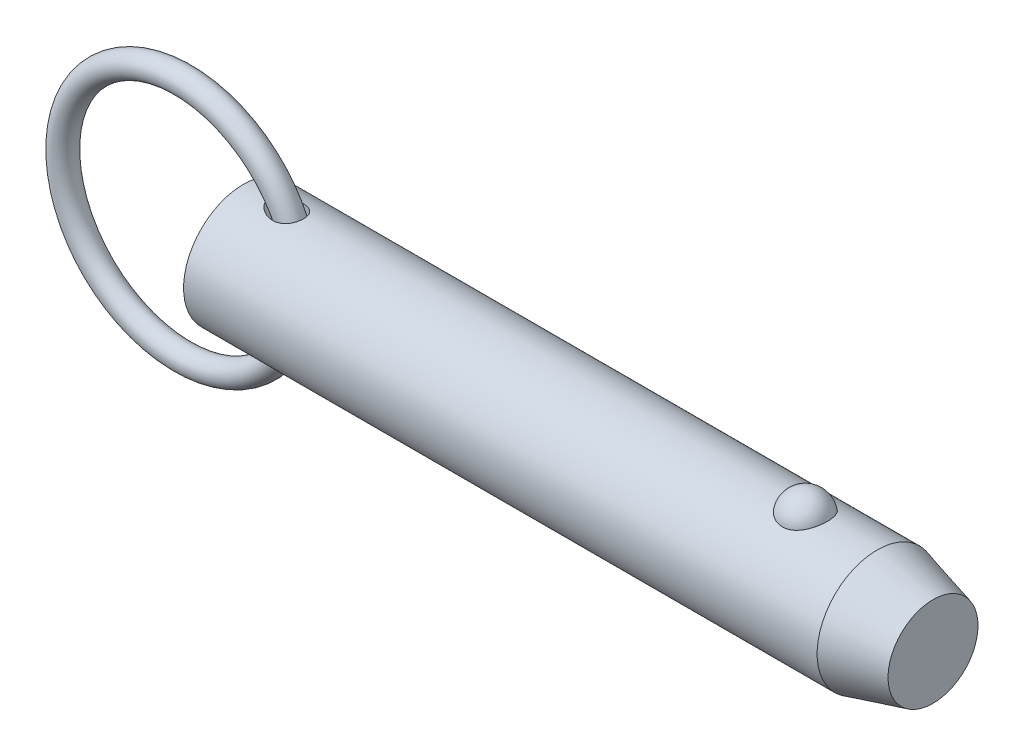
ISO-10303-21;
HEADER;
FILE_DESCRIPTION(('STEP AP214'),'2;1');
FILE_NAME('part.step','',(''),(''),'','','');
FILE_SCHEMA(('AUTOMOTIVE_DESIGN { 1 0 10303 214 1 1 1 1 }'));
ENDSEC;
DATA;
#1=APPLICATION_CONTEXT('core data for automotive mechanical design processes');
#2=APPLICATION_PROTOCOL_DEFINITION('international standard','automotive_design',2000,#1);
#3=PRODUCT_CONTEXT('',#1,'mechanical');
#4=PRODUCT('Part','Part','',(#3));
#5=PRODUCT_RELATED_PRODUCT_CATEGORY('part','',(#4));
#6=PRODUCT_DEFINITION_FORMATION('','',#4);
#7=PRODUCT_DEFINITION_CONTEXT('part definition',#1,'design');
#8=PRODUCT_DEFINITION('design','',#6,#7);
#9=PRODUCT_DEFINITION_SHAPE('','',#8);
#10=(LENGTH_UNIT() NAMED_UNIT(*) SI_UNIT(.MILLI.,.METRE.));
#11=(NAMED_UNIT(*) PLANE_ANGLE_UNIT() SI_UNIT($,.RADIAN.));
#12=(NAMED_UNIT(*) SI_UNIT($,.STERADIAN.) SOLID_ANGLE_UNIT());
#13=UNCERTAINTY_MEASURE_WITH_UNIT(LENGTH_MEASURE(1.E-05),#10,'distance_accuracy_value','');
#14=(GEOMETRIC_REPRESENTATION_CONTEXT(3) GLOBAL_UNCERTAINTY_ASSIGNED_CONTEXT((#13)) GLOBAL_UNIT_ASSIGNED_CONTEXT((#10,
#11,#12)) REPRESENTATION_CONTEXT('',''));
#15=CARTESIAN_POINT('',(0.,0.,0.));
#16=DIRECTION('',(0.,0.,1.));
#17=DIRECTION('',(1.,0.,0.));
#18=AXIS2_PLACEMENT_3D('',#15,#16,#17);
#19=CARTESIAN_POINT('',(-9.66825126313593,0.,0.));
#20=DIRECTION('',(0.,0.,1.));
#21=DIRECTION('',(1.,0.,0.));
#22=AXIS2_PLACEMENT_3D('',#19,#20,#21);
#23=TOROIDAL_SURFACE('',#22,19.05,1.905);
#24=CARTESIAN_POINT('',(11.2867487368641,0.,0.));
#25=VERTEX_POINT('',#24);
#26=VERTEX_LOOP('',#25);
#27=FACE_BOUND('',#26,.T.);
#28=ADVANCED_FACE('P0_F12',(#27),#23,.T.);
#29=CLOSED_SHELL('',(#28));
#30=MANIFOLD_SOLID_BREP('P0_B1',#29);
#31=CARTESIAN_POINT('',(0.,0.,0.));
#32=DIRECTION('',(1.,0.,0.));
#33=DIRECTION('',(0.,0.,-1.));
#34=AXIS2_PLACEMENT_3D('',#31,#32,#33);
#35=CYLINDRICAL_SURFACE('',#34,9.525);
#36=CARTESIAN_POINT('',(4.56693409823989,9.4314194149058,-1.33189820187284));
#37=CARTESIAN_POINT('',(4.70260475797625,9.41020313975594,-1.48215931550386));
#38=CARTESIAN_POINT('',(4.85555680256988,9.38755003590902,-1.61683982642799));
#39=CARTESIAN_POINT('',(5.10171959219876,9.35450554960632,-1.79512943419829));
#40=CARTESIAN_POINT('',(5.18674514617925,9.34362629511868,-1.85068909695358));
#41=CARTESIAN_POINT('',(5.3615438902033,9.32258514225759,-1.95392002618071));
#42=CARTESIAN_POINT('',(5.45131542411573,9.31242299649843,-2.00159402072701));
#43=CARTESIAN_POINT('',(5.70070211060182,9.28632120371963,-2.12033289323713));
#44=CARTESIAN_POINT('',(5.86420408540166,9.27146938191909,-2.18362944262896));
#45=CARTESIAN_POINT('',(6.19893345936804,9.24694163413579,-2.28525783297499));
#46=CARTESIAN_POINT('',(6.3701538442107,9.23726110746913,-2.32361187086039));
#47=CARTESIAN_POINT('',(6.73531776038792,9.22400982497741,-2.37575048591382));
#48=CARTESIAN_POINT('',(6.92975826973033,9.22118808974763,-2.38652934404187));
#49=CARTESIAN_POINT('',(7.21995443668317,9.22416297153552,-2.37494980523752));
#50=CARTESIAN_POINT('',(7.31643847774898,9.22635560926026,-2.366466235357));
#51=CARTESIAN_POINT('',(7.50796421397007,9.2331428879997,-2.33985028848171));
#52=CARTESIAN_POINT('',(7.60300650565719,9.23773650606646,-2.32172202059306));
#53=CARTESIAN_POINT('',(7.83273114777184,9.25183311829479,-2.26504721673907));
#54=CARTESIAN_POINT('',(7.96603028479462,9.26261470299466,-2.2209856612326));
#55=CARTESIAN_POINT('',(8.22310899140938,9.28816519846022,-2.1115730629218));
#56=CARTESIAN_POINT('',(8.34689477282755,9.30293147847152,-2.04623606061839));
#57=CARTESIAN_POINT('',(8.58136049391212,9.3349416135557,-1.89485344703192));
#58=CARTESIAN_POINT('',(8.69199721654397,9.35219324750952,-1.8087422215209));
#59=CARTESIAN_POINT('',(8.89592093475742,9.38707016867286,-1.6179918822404));
#60=CARTESIAN_POINT('',(8.98920771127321,9.40469546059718,-1.51335253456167));
#61=CARTESIAN_POINT('',(9.15057731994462,9.43713590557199,-1.29519427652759));
#62=CARTESIAN_POINT('',(9.21980158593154,9.45205440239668,-1.18253282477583));
#63=CARTESIAN_POINT('',(9.33826736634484,9.47856708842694,-0.946802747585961));
#64=CARTESIAN_POINT('',(9.38751161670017,9.49016173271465,-0.823735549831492));
#65=CARTESIAN_POINT('',(9.46423850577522,9.50859378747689,-0.572614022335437));
#66=CARTESIAN_POINT('',(9.4920239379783,9.5154972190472,-0.444656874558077));
#67=CARTESIAN_POINT('',(9.52636926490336,9.5240690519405,-0.185752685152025));
#68=CARTESIAN_POINT('',(9.53292923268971,9.52573747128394,-0.054805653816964));
#69=CARTESIAN_POINT('',(9.52467276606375,9.52365852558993,0.206503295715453));
#70=CARTESIAN_POINT('',(9.50983454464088,9.51990564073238,0.336864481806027));
#71=CARTESIAN_POINT('',(9.45907362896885,9.50737852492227,0.593166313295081));
#72=CARTESIAN_POINT('',(9.42315106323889,9.49860432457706,0.719106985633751));
#73=CARTESIAN_POINT('',(9.3310664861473,9.4769892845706,0.962959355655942));
#74=CARTESIAN_POINT('',(9.27490839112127,9.46414923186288,1.08087260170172));
#75=CARTESIAN_POINT('',(9.14375803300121,9.43581000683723,1.30534632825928));
#76=CARTESIAN_POINT('',(9.06876720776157,9.42031103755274,1.41190767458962));
#77=CARTESIAN_POINT('',(8.90203187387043,9.38836719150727,1.61069439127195));
#78=CARTESIAN_POINT('',(8.81029913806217,9.371922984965,1.70292975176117));
#79=CARTESIAN_POINT('',(8.6126877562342,9.33985045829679,1.87086859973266));
#80=CARTESIAN_POINT('',(8.50680947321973,9.3242221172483,1.94657251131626));
#81=CARTESIAN_POINT('',(8.28220546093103,9.29513431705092,2.08109032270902));
#82=CARTESIAN_POINT('',(8.16329919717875,9.28171415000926,2.13961034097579));
#83=CARTESIAN_POINT('',(7.91756052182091,9.25859072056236,2.23755716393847));
#84=CARTESIAN_POINT('',(7.79072606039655,9.24888842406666,2.27697900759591));
#85=CARTESIAN_POINT('',(7.52377913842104,9.23338749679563,2.33907806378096));
#86=CARTESIAN_POINT('',(7.3833476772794,9.22789571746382,2.36044900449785));
#87=CARTESIAN_POINT('',(7.1008139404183,9.22210229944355,2.3829751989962));
#88=CARTESIAN_POINT('',(6.95871103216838,9.22180269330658,2.38412253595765));
#89=CARTESIAN_POINT('',(6.65642691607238,9.22632724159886,2.36656230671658));
#90=CARTESIAN_POINT('',(6.49641694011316,9.23185415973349,2.3451317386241));
#91=CARTESIAN_POINT('',(6.18115433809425,9.24811737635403,2.28014143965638));
#92=CARTESIAN_POINT('',(6.02590710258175,9.25885936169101,2.23655754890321));
#93=CARTESIAN_POINT('',(5.69904720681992,9.28624254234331,2.12025087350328));
#94=CARTESIAN_POINT('',(5.52873601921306,9.30354853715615,2.04400672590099));
#95=CARTESIAN_POINT('',(5.20289495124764,9.34106989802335,1.86504730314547));
#96=CARTESIAN_POINT('',(5.0473596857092,9.36128419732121,1.76234172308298));
#97=CARTESIAN_POINT('',(4.7928712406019,9.39697639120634,1.55895334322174));
#98=CARTESIAN_POINT('',(4.68938704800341,9.41240250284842,1.46392900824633));
#99=CARTESIAN_POINT('',(4.4984714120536,9.44202586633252,1.25875918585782));
#100=CARTESIAN_POINT('',(4.41101129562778,9.45622528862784,1.1486413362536));
#101=CARTESIAN_POINT('',(4.27502257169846,9.47888210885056,0.94060098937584));
#102=CARTESIAN_POINT('',(4.22216329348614,9.48791121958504,0.845586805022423));
#103=CARTESIAN_POINT('',(4.13241478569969,9.50344321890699,0.648051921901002));
#104=CARTESIAN_POINT('',(4.0955118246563,9.50994827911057,0.545537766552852));
#105=CARTESIAN_POINT('',(4.04043124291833,9.51971586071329,0.334452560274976));
#106=CARTESIAN_POINT('',(4.02240728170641,9.52295176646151,0.225839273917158));
#107=CARTESIAN_POINT('',(4.00750873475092,9.52562364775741,0.00713006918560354));
#108=CARTESIAN_POINT('',(4.01062334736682,9.52506156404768,-0.102965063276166));
#109=CARTESIAN_POINT('',(4.03592967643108,9.52053221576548,-0.306944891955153));
#110=CARTESIAN_POINT('',(4.05571676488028,9.51699426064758,-0.401151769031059));
#111=CARTESIAN_POINT('',(4.10967975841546,9.5074546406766,-0.585176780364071));
#112=CARTESIAN_POINT('',(4.1438599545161,9.50145224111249,-0.674993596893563));
#113=CARTESIAN_POINT('',(4.23261356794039,9.48611703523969,-0.866116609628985));
#114=CARTESIAN_POINT('',(4.28990016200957,9.47635800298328,-0.966121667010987));
#115=CARTESIAN_POINT('',(4.4185657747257,9.45502867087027,-1.15640011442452));
#116=CARTESIAN_POINT('',(4.4899691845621,9.44345524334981,-1.24665623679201));
#117=CARTESIAN_POINT('',(4.56693409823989,9.4314194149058,-1.33189820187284));
#118=B_SPLINE_CURVE_WITH_KNOTS('',3,(#36,#37,#38,#39,#40,#41,#42,#43,#44,#45,#46,#47,#48,#49,
#50,#51,#52,#53,#54,#55,#56,#57,#58,#59,#60,#61,#62,#63,#64,#65,#66,#67,#68,#69,#70,#71,#72,#73,
#74,#75,#76,#77,#78,#79,#80,#81,#82,#83,#84,#85,#86,#87,#88,#89,#90,#91,#92,#93,#94,#95,#96,#97,
#98,#99,#100,#101,#102,#103,#104,#105,#106,#107,#108,#109,#110,#111,#112,#113,#114,#115,#116,
#117),.UNSPECIFIED.,.T.,.F.,(4,2,2,2,2,2,2,2,2,2,2,2,2,2,2,2,2,2,2,2,2,2,2,2,2,2,2,2,2,2,2,2,2,
2,2,2,2,2,2,2,4),(0.,0.609951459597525,0.916123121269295,1.22218863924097,1.74791337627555,
2.27316961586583,2.85362722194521,3.14383229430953,3.43391382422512,3.85437497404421,
4.27455920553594,4.69608835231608,5.11762282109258,5.51490051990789,5.91212379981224,
6.30363414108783,6.69514313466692,7.0870510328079,7.47895654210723,7.87078624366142,
8.26258603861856,8.65411137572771,9.0456266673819,9.44349251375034,9.84146165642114,
10.2662286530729,10.6911619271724,11.1739180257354,11.6572017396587,12.2170157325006,
12.776624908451,13.1992556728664,13.6211226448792,13.9471990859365,14.2729943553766,
14.6014211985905,14.9296802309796,15.2173810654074,15.505167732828,15.8505863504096,
16.1966070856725),.UNSPECIFIED.);
#119=CARTESIAN_POINT('',(4.56693409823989,9.4314194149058,-1.33189820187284));
#120=VERTEX_POINT('',#119);
#121=EDGE_CURVE('P1_E40',#120,#120,#118,.T.);
#122=ORIENTED_EDGE('',*,*,#121,.T.);
#123=EDGE_LOOP('',(#122));
#124=FACE_BOUND('',#123,.T.);
#125=CARTESIAN_POINT('',(100.643054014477,0.,0.));
#126=DIRECTION('',(1.,0.,0.));
#127=DIRECTION('',(0.,0.,-1.));
#128=AXIS2_PLACEMENT_3D('',#125,#126,#127);
#129=CIRCLE('',#128,9.525);
#130=CARTESIAN_POINT('',(100.643054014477,0.,-9.525));
#131=VERTEX_POINT('',#130);
#132=EDGE_CURVE('P1_E25',#131,#131,#129,.T.);
#133=ORIENTED_EDGE('',*,*,#132,.F.);
#134=EDGE_LOOP('',(#133));
#135=FACE_BOUND('',#134,.T.);
#136=CARTESIAN_POINT('',(0.,0.,0.));
#137=DIRECTION('',(1.,0.,0.));
#138=DIRECTION('',(0.,0.,-1.));
#139=AXIS2_PLACEMENT_3D('',#136,#137,#138);
#140=CIRCLE('',#139,9.525);
#141=CARTESIAN_POINT('',(0.,0.,-9.525));
#142=VERTEX_POINT('',#141);
#143=EDGE_CURVE('P1_E9',#142,#142,#140,.T.);
#144=ORIENTED_EDGE('',*,*,#143,.T.);
#145=EDGE_LOOP('',(#144));
#146=FACE_BOUND('',#145,.T.);
#147=CARTESIAN_POINT('',(89.2457573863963,8.80405803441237,3.63513233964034));
#148=CARTESIAN_POINT('',(89.1516766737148,8.80405953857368,3.63513053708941));
#149=CARTESIAN_POINT('',(89.0575618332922,8.80561325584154,3.63137461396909));
#150=CARTESIAN_POINT('',(88.8700126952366,8.81177748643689,3.61638665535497));
#151=CARTESIAN_POINT('',(88.7765788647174,8.81638992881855,3.60514990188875));
#152=CARTESIAN_POINT('',(88.4979452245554,8.83467114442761,3.56024627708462));
#153=CARTESIAN_POINT('',(88.3146916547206,8.85278327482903,3.5153862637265));
#154=CARTESIAN_POINT('',(87.959509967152,8.89871214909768,3.39742145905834));
#155=CARTESIAN_POINT('',(87.7875533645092,8.92650327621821,3.32439116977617));
#156=CARTESIAN_POINT('',(87.458707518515,8.98874819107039,3.15220244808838));
#157=CARTESIAN_POINT('',(87.3018114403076,9.02319893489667,3.05305594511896));
#158=CARTESIAN_POINT('',(87.0022147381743,9.09629186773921,2.82797815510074));
#159=CARTESIAN_POINT('',(86.8600600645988,9.13502685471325,2.70135138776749));
#160=CARTESIAN_POINT('',(86.5982999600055,9.2118657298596,2.42641932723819));
#161=CARTESIAN_POINT('',(86.4787015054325,9.2499694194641,2.27810735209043));
#162=CARTESIAN_POINT('',(86.259645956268,9.32341082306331,1.95652290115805));
#163=CARTESIAN_POINT('',(86.1613174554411,9.35855090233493,1.78243511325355));
#164=CARTESIAN_POINT('',(85.9938190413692,9.42045142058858,1.419372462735));
#165=CARTESIAN_POINT('',(85.9246511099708,9.44721128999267,1.23039658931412));
#166=CARTESIAN_POINT('',(85.8161994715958,9.48990641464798,0.840370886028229));
#167=CARTESIAN_POINT('',(85.7772880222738,9.50570658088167,0.639202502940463));
#168=CARTESIAN_POINT('',(85.7315550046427,9.52433146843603,0.232664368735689));
#169=CARTESIAN_POINT('',(85.7247324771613,9.52715657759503,0.0272947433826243));
#170=CARTESIAN_POINT('',(85.743255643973,9.51956918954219,-0.380478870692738));
#171=CARTESIAN_POINT('',(85.7684052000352,9.50923740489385,-0.58289331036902));
#172=CARTESIAN_POINT('',(85.8500253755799,9.47651897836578,-0.980293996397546));
#173=CARTESIAN_POINT('',(85.9064966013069,9.45413210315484,-1.17528009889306));
#174=CARTESIAN_POINT('',(86.0497192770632,9.39954044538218,-1.55263697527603));
#175=CARTESIAN_POINT('',(86.1365124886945,9.36732213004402,-1.73498993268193));
#176=CARTESIAN_POINT('',(86.3386103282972,9.29640700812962,-2.08177763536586));
#177=CARTESIAN_POINT('',(86.4539172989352,9.25770966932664,-2.24621090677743));
#178=CARTESIAN_POINT('',(86.711264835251,9.17775604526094,-2.5533833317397));
#179=CARTESIAN_POINT('',(86.8534344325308,9.136488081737,-2.696011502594));
#180=CARTESIAN_POINT('',(87.16089985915,9.05620497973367,-2.95451229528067));
#181=CARTESIAN_POINT('',(87.326193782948,9.01718965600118,-3.070387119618));
#182=CARTESIAN_POINT('',(87.672052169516,8.94680019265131,-3.26976836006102));
#183=CARTESIAN_POINT('',(87.8522278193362,8.91528408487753,-3.353897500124));
#184=CARTESIAN_POINT('',(88.2256514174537,8.86272514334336,-3.49043503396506));
#185=CARTESIAN_POINT('',(88.418894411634,8.84167836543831,-3.54285537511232));
#186=CARTESIAN_POINT('',(88.8025036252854,8.81348056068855,-3.61241306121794));
#187=CARTESIAN_POINT('',(88.9925251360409,8.80568348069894,-3.6311933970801));
#188=CARTESIAN_POINT('',(89.3731906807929,8.80289410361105,-3.63795342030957));
#189=CARTESIAN_POINT('',(89.5638345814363,8.80789922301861,-3.62593932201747));
#190=CARTESIAN_POINT('',(89.934007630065,8.82974915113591,-3.57238430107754));
#191=CARTESIAN_POINT('',(90.1136976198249,8.84621463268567,-3.53178890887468));
#192=CARTESIAN_POINT('',(90.4634226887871,8.88875330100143,-3.42331083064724));
#193=CARTESIAN_POINT('',(90.6334569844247,8.91482726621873,-3.35542593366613));
#194=CARTESIAN_POINT('',(90.9632377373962,8.97448239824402,-3.19248225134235));
#195=CARTESIAN_POINT('',(91.1226801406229,9.00821446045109,-3.0968647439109));
#196=CARTESIAN_POINT('',(91.4235136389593,9.07935398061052,-2.88162736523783));
#197=CARTESIAN_POINT('',(91.5649005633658,9.11676228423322,-2.76200196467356));
#198=CARTESIAN_POINT('',(91.8333193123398,9.19347419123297,-2.49516285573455));
#199=CARTESIAN_POINT('',(91.9592750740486,9.23277872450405,-2.34686614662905));
#200=CARTESIAN_POINT('',(92.1855227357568,9.3073761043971,-2.0309368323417));
#201=CARTESIAN_POINT('',(92.2858100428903,9.34266823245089,-1.86330077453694));
#202=CARTESIAN_POINT('',(92.4615149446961,9.40674710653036,-1.50744893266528));
#203=CARTESIAN_POINT('',(92.536041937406,9.43529176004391,-1.31874876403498));
#204=CARTESIAN_POINT('',(92.6541650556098,9.48144132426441,-0.930631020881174));
#205=CARTESIAN_POINT('',(92.6977608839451,9.49904612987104,-0.731213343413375));
#206=CARTESIAN_POINT('',(92.7531580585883,9.5215314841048,-0.327147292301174));
#207=CARTESIAN_POINT('',(92.7649354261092,9.52640243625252,-0.122495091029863));
#208=CARTESIAN_POINT('',(92.7563825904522,9.5228957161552,0.286018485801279));
#209=CARTESIAN_POINT('',(92.7360530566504,9.5145183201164,0.489879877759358));
#210=CARTESIAN_POINT('',(92.6638840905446,9.48544083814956,0.88999431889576));
#211=CARTESIAN_POINT('',(92.6121993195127,9.46480124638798,1.08627971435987));
#212=CARTESIAN_POINT('',(92.4784917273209,9.4133389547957,1.46682086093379));
#213=CARTESIAN_POINT('',(92.3964668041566,9.38251554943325,1.65107577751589));
#214=CARTESIAN_POINT('',(92.2031929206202,9.31365636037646,2.00346348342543));
#215=CARTESIAN_POINT('',(92.0917838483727,9.27558138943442,2.17150083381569));
#216=CARTESIAN_POINT('',(91.8422947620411,9.19638714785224,2.4856311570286));
#217=CARTESIAN_POINT('',(91.7042163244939,9.15526805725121,2.63172542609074));
#218=CARTESIAN_POINT('',(91.4048438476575,9.07465393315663,2.89750997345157));
#219=CARTESIAN_POINT('',(91.2436109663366,9.03515496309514,3.01726776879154));
#220=CARTESIAN_POINT('',(90.9016136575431,8.96227564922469,3.22732920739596));
#221=CARTESIAN_POINT('',(90.720841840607,8.92889763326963,3.31762165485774));
#222=CARTESIAN_POINT('',(90.3514451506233,8.8734538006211,3.46314419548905));
#223=CARTESIAN_POINT('',(90.1633237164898,8.85102983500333,3.51950082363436));
#224=CARTESIAN_POINT('',(89.8757869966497,8.8266696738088,3.57993683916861));
#225=CARTESIAN_POINT('',(89.7791339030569,8.82009725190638,3.5960621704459));
#226=CARTESIAN_POINT('',(89.5846770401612,8.81020897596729,3.62022512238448));
#227=CARTESIAN_POINT('',(89.4868741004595,8.80689090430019,3.62826825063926));
#228=CARTESIAN_POINT('',(89.3412243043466,8.80445615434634,3.63416760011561));
#229=CARTESIAN_POINT('',(89.2934952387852,8.80405727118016,3.63513325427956));
#230=CARTESIAN_POINT('',(89.2457573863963,8.80405803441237,3.63513233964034));
#231=B_SPLINE_CURVE_WITH_KNOTS('',3,(#147,#148,#149,#150,#151,#152,#153,#154,#155,#156,#157,
#158,#159,#160,#161,#162,#163,#164,#165,#166,#167,#168,#169,#170,#171,#172,#173,#174,#175,#176,
#177,#178,#179,#180,#181,#182,#183,#184,#185,#186,#187,#188,#189,#190,#191,#192,#193,#194,#195,
#196,#197,#198,#199,#200,#201,#202,#203,#204,#205,#206,#207,#208,#209,#210,#211,#212,#213,#214,
#215,#216,#217,#218,#219,#220,#221,#222,#223,#224,#225,#226,#227,#228,#229,#230),.UNSPECIFIED.,
.T.,.F.,(4,2,2,2,2,2,2,2,2,2,2,2,2,2,2,2,2,2,2,2,2,2,2,2,2,2,2,2,2,2,2,2,2,2,2,2,2,2,2,2,2,4),
(0.,0.282202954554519,0.564584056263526,1.13017050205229,1.69427128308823,2.25811483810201,
2.83836627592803,3.4187968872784,4.02497117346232,4.63118665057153,5.24474754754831,
5.85829010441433,6.46808687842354,7.07789545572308,7.68854723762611,8.29924920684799,
8.9129628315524,9.52662591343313,10.1275338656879,10.7282152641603,11.2986646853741,
11.8689989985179,12.4213015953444,12.973648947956,13.5380053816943,14.1024919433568,
14.695298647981,15.2882113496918,15.8999469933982,16.5116885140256,17.1238909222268,
17.7360805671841,18.3452748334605,18.9545113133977,19.567138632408,20.179729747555,
20.7907316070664,21.4019653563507,21.9915938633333,22.2859053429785,22.5800161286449,
22.7232098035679),.UNSPECIFIED.);
#232=CARTESIAN_POINT('',(89.2457573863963,8.80405803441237,3.63513233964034));
#233=VERTEX_POINT('',#232);
#234=EDGE_CURVE('P1_E34',#233,#233,#231,.T.);
#235=ORIENTED_EDGE('',*,*,#234,.T.);
#236=EDGE_LOOP('',(#235));
#237=FACE_BOUND('',#236,.T.);
#238=CARTESIAN_POINT('',(4.56693409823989,-9.4314194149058,-1.33189820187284));
#239=CARTESIAN_POINT('',(4.48932984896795,-9.4435553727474,-1.24594548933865));
#240=CARTESIAN_POINT('',(4.41737309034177,-9.45522193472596,-1.1548795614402));
#241=CARTESIAN_POINT('',(4.2878104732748,-9.47670896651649,-0.962782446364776));
#242=CARTESIAN_POINT('',(4.23019403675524,-9.48653079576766,-0.861758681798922));
#243=CARTESIAN_POINT('',(4.132545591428,-9.5034118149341,-0.649723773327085));
#244=CARTESIAN_POINT('',(4.09271158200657,-9.51043980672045,-0.538615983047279));
#245=CARTESIAN_POINT('',(4.04973167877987,-9.51806966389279,-0.367764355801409));
#246=CARTESIAN_POINT('',(4.03820037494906,-9.52012756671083,-0.310118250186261));
#247=CARTESIAN_POINT('',(4.02100287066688,-9.52320274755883,-0.193935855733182));
#248=CARTESIAN_POINT('',(4.01533565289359,-9.52422020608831,-0.135399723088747));
#249=CARTESIAN_POINT('',(4.0081707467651,-9.52550497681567,0.0247266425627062));
#250=CARTESIAN_POINT('',(4.01270492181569,-9.52468821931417,0.126661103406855));
#251=CARTESIAN_POINT('',(4.03954973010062,-9.51988506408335,0.328012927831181));
#252=CARTESIAN_POINT('',(4.06186450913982,-9.51589792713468,0.427429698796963));
#253=CARTESIAN_POINT('',(4.12088980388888,-9.50548528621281,0.616362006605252));
#254=CARTESIAN_POINT('',(4.15684838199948,-9.49918763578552,0.706123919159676));
#255=CARTESIAN_POINT('',(4.24094647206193,-9.48470618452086,0.879522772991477));
#256=CARTESIAN_POINT('',(4.28909090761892,-9.47652162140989,0.963157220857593));
#257=CARTESIAN_POINT('',(4.42295891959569,-9.45426317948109,1.16513741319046));
#258=CARTESIAN_POINT('',(4.51523752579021,-9.43933320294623,1.27905352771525));
#259=CARTESIAN_POINT('',(4.71682295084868,-9.40825940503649,1.49055892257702));
#260=CARTESIAN_POINT('',(4.82617286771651,-9.39211256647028,1.58810554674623));
#261=CARTESIAN_POINT('',(5.09064226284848,-9.35555264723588,1.79246125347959));
#262=CARTESIAN_POINT('',(5.2499041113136,-9.33524115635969,1.89393122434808));
#263=CARTESIAN_POINT('',(5.58309255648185,-9.29785396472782,2.06968659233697));
#264=CARTESIAN_POINT('',(5.75702897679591,-9.28078045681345,2.14395359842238));
#265=CARTESIAN_POINT('',(6.11646882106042,-9.25213303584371,2.26440412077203));
#266=CARTESIAN_POINT('',(6.30205582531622,-9.2406056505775,2.31035092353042));
#267=CARTESIAN_POINT('',(6.67856093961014,-9.22541807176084,2.37029728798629));
#268=CARTESIAN_POINT('',(6.8694704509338,-9.2217458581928,2.3843456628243));
#269=CARTESIAN_POINT('',(7.21217144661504,-9.2234423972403,2.37775005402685));
#270=CARTESIAN_POINT('',(7.36409439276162,-9.22713860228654,2.36352577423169));
#271=CARTESIAN_POINT('',(7.66346227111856,-9.24048072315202,2.31082299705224));
#272=CARTESIAN_POINT('',(7.81090958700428,-9.25012341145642,2.27235765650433));
#273=CARTESIAN_POINT('',(8.09730316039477,-9.2746609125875,2.17003648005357));
#274=CARTESIAN_POINT('',(8.23619652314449,-9.28958517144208,2.10603803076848));
#275=CARTESIAN_POINT('',(8.49918675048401,-9.32290326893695,1.95324442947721));
#276=CARTESIAN_POINT('',(8.62328895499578,-9.34129584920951,1.86445826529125));
#277=CARTESIAN_POINT('',(8.84006515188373,-9.37706953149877,1.67466761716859));
#278=CARTESIAN_POINT('',(8.93465172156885,-9.39436331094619,1.57582357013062));
#279=CARTESIAN_POINT('',(9.1049023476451,-9.42761680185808,1.362809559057));
#280=CARTESIAN_POINT('',(9.18057146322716,-9.44357686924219,1.24864370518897));
#281=CARTESIAN_POINT('',(9.30789178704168,-9.47159985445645,1.01379272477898));
#282=CARTESIAN_POINT('',(9.36045544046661,-9.48380365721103,0.893617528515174));
#283=CARTESIAN_POINT('',(9.44498362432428,-9.50388751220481,0.645890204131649));
#284=CARTESIAN_POINT('',(9.47694947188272,-9.51176784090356,0.518338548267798));
#285=CARTESIAN_POINT('',(9.51944262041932,-9.52232073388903,0.260103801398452));
#286=CARTESIAN_POINT('',(9.53006646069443,-9.52501674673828,0.129437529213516));
#287=CARTESIAN_POINT('',(9.52993291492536,-9.52498309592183,-0.131885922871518));
#288=CARTESIAN_POINT('',(9.5191752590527,-9.52225336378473,-0.262543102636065));
#289=CARTESIAN_POINT('',(9.47648788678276,-9.51165418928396,-0.520312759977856));
#290=CARTESIAN_POINT('',(9.44453086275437,-9.50377811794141,-0.647420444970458));
#291=CARTESIAN_POINT('',(9.36015568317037,-9.48373425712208,-0.894290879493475));
#292=CARTESIAN_POINT('',(9.30773827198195,-9.47156662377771,-1.01405389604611));
#293=CARTESIAN_POINT('',(9.1838089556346,-9.44428888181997,-1.24269386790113));
#294=CARTESIAN_POINT('',(9.11232064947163,-9.42918241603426,-1.35158405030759));
#295=CARTESIAN_POINT('',(8.9521268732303,-9.39767706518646,-1.55562459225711));
#296=CARTESIAN_POINT('',(8.86342281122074,-9.3812782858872,-1.65077607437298));
#297=CARTESIAN_POINT('',(8.67104443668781,-9.34891827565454,-1.8251751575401));
#298=CARTESIAN_POINT('',(8.56732858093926,-9.33295841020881,-1.90437711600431));
#299=CARTESIAN_POINT('',(8.34818438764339,-9.30317889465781,-2.0449122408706));
#300=CARTESIAN_POINT('',(8.23275529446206,-9.28935938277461,-2.10624425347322));
#301=CARTESIAN_POINT('',(7.98961240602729,-9.26475003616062,-2.2120340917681));
#302=CARTESIAN_POINT('',(7.86162088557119,-9.25407358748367,-2.25587700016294));
#303=CARTESIAN_POINT('',(7.60027499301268,-9.23720810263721,-2.32397032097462));
#304=CARTESIAN_POINT('',(7.46691858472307,-9.23102078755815,-2.34821321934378));
#305=CARTESIAN_POINT('',(7.18516230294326,-9.22302718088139,-2.37943079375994));
#306=CARTESIAN_POINT('',(7.03654454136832,-9.22169704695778,-2.38452997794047));
#307=CARTESIAN_POINT('',(6.7401504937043,-9.22442327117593,-2.37395141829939));
#308=CARTESIAN_POINT('',(6.59237455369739,-9.22848170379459,-2.35826567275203));
#309=CARTESIAN_POINT('',(6.27762777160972,-9.2422287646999,-2.30385559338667));
#310=CARTESIAN_POINT('',(6.11124715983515,-9.25269504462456,-2.26192683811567));
#311=CARTESIAN_POINT('',(5.78635920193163,-9.27830776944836,-2.15445569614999));
#312=CARTESIAN_POINT('',(5.62786567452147,-9.29346211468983,-2.08887341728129));
#313=CARTESIAN_POINT('',(5.39013065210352,-9.31931237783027,-1.96924953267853));
#314=CARTESIAN_POINT('',(5.30683088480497,-9.32901725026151,-1.92292485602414));
#315=CARTESIAN_POINT('',(5.1445580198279,-9.34899035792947,-1.82334419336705));
#316=CARTESIAN_POINT('',(5.06558607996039,-9.35925874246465,-1.77008636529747));
#317=CARTESIAN_POINT('',(4.83670950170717,-9.39034445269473,-1.60010986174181));
#318=CARTESIAN_POINT('',(4.69422471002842,-9.41151337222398,-1.47288240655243));
#319=CARTESIAN_POINT('',(4.56693409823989,-9.4314194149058,-1.33189820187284));
#320=B_SPLINE_CURVE_WITH_KNOTS('',3,(#238,#239,#240,#241,#242,#243,#244,#245,#246,#247,#248,
#249,#250,#251,#252,#253,#254,#255,#256,#257,#258,#259,#260,#261,#262,#263,#264,#265,#266,#267,
#268,#269,#270,#271,#272,#273,#274,#275,#276,#277,#278,#279,#280,#281,#282,#283,#284,#285,#286,
#287,#288,#289,#290,#291,#292,#293,#294,#295,#296,#297,#298,#299,#300,#301,#302,#303,#304,#305,
#306,#307,#308,#309,#310,#311,#312,#313,#314,#315,#316,#317,#318,#319),.UNSPECIFIED.,.T.,.F.,(4,
2,2,2,2,2,2,2,2,2,2,2,2,2,2,2,2,2,2,2,2,2,2,2,2,2,2,2,2,2,2,2,2,2,2,2,2,2,2,2,4),(0.,
0.348900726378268,0.697543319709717,1.0499765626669,1.22617690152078,1.40234666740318,
1.70666745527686,2.01105922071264,2.30066493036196,2.59038784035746,3.03001384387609,
3.4707682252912,4.03766594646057,4.60494622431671,5.17690598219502,5.74798989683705,
6.20400848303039,6.65977977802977,7.11813321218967,7.57632066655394,7.98791759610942,
8.39940433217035,8.79273459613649,9.18603970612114,9.57756168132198,9.96908859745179,
10.3611208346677,10.7531388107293,11.1446739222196,11.536177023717,11.9287850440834,
12.3214184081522,12.7268448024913,13.1324265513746,13.5768390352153,14.0214226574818,
14.5351685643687,15.0497849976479,15.3368801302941,15.6240516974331,16.1963372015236),.UNSPECIFIED.);
#321=CARTESIAN_POINT('',(4.56693409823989,-9.4314194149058,-1.33189820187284));
#322=VERTEX_POINT('',#321);
#323=EDGE_CURVE('P1_E17',#322,#322,#320,.T.);
#324=ORIENTED_EDGE('',*,*,#323,.T.);
#325=EDGE_LOOP('',(#324));
#326=FACE_BOUND('',#325,.T.);
#327=ADVANCED_FACE('P1_F13',(#124,#135,#146,#237,#326),#35,.T.);
#328=CARTESIAN_POINT('',(0.,0.,0.));
#329=DIRECTION('',(-1.,0.,0.));
#330=DIRECTION('',(0.,0.,1.));
#331=AXIS2_PLACEMENT_3D('',#328,#329,#330);
#332=PLANE('',#331);
#333=ORIENTED_EDGE('',*,*,#143,.F.);
#334=EDGE_LOOP('',(#333));
#335=FACE_BOUND('',#334,.T.);
#336=ADVANCED_FACE('P1_F15',(#335),#332,.T.);
#337=CARTESIAN_POINT('',(109.53,0.,0.));
#338=DIRECTION('',(-1.,0.,0.));
#339=DIRECTION('',(0.,0.,1.));
#340=AXIS2_PLACEMENT_3D('',#337,#338,#339);
#341=CONICAL_SURFACE('',#340,7.14375000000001,0.26179938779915);
#342=ORIENTED_EDGE('',*,*,#132,.T.);
#343=EDGE_LOOP('',(#342));
#344=FACE_BOUND('',#343,.T.);
#345=CARTESIAN_POINT('',(109.53,0.,0.));
#346=DIRECTION('',(1.,0.,0.));
#347=DIRECTION('',(0.,0.,-1.));
#348=AXIS2_PLACEMENT_3D('',#345,#346,#347);
#349=CIRCLE('',#348,7.14375000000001);
#350=CARTESIAN_POINT('',(109.53,0.,-7.14375000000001));
#351=VERTEX_POINT('',#350);
#352=EDGE_CURVE('P1_E30',#351,#351,#349,.T.);
#353=ORIENTED_EDGE('',*,*,#352,.F.);
#354=EDGE_LOOP('',(#353));
#355=FACE_BOUND('',#354,.T.);
#356=ADVANCED_FACE('P1_F55',(#344,#355),#341,.T.);
#357=CARTESIAN_POINT('',(109.53,7.14375000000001,0.));
#358=DIRECTION('',(1.,0.,0.));
#359=DIRECTION('',(0.,0.,-1.));
#360=AXIS2_PLACEMENT_3D('',#357,#358,#359);
#361=PLANE('',#360);
#362=ORIENTED_EDGE('',*,*,#352,.T.);
#363=EDGE_LOOP('',(#362));
#364=FACE_BOUND('',#363,.T.);
#365=ADVANCED_FACE('P1_F51',(#364),#361,.T.);
#366=CARTESIAN_POINT('',(89.2457573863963,8.5725,0.));
#367=DIRECTION('',(-1.,0.,0.));
#368=DIRECTION('',(0.,1.,0.));
#369=AXIS2_PLACEMENT_3D('',#366,#367,#368);
#370=SPHERICAL_SURFACE('',#369,3.64249999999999);
#371=ORIENTED_EDGE('',*,*,#234,.F.);
#372=EDGE_LOOP('',(#371));
#373=FACE_BOUND('',#372,.T.);
#374=ADVANCED_FACE('P1_F46',(#373),#370,.T.);
#375=CARTESIAN_POINT('',(-9.66825126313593,0.,0.));
#376=DIRECTION('',(0.,0.,1.));
#377=DIRECTION('',(1.,0.,0.));
#378=AXIS2_PLACEMENT_3D('',#375,#376,#377);
#379=TOROIDAL_SURFACE('',#378,19.05,2.38125);
#380=ORIENTED_EDGE('',*,*,#323,.F.);
#381=EDGE_LOOP('',(#380));
#382=FACE_BOUND('',#381,.T.);
#383=ORIENTED_EDGE('',*,*,#121,.F.);
#384=EDGE_LOOP('',(#383));
#385=FACE_BOUND('',#384,.T.);
#386=ADVANCED_FACE('P1_F50',(#382,#385),#379,.F.);
#387=CLOSED_SHELL('',(#327,#336,#356,#365,#374,#386));
#388=MANIFOLD_SOLID_BREP('P1_B1',#387);
#389=ADVANCED_BREP_SHAPE_REPRESENTATION('',(#18,#30,#388),#14);
#390=SHAPE_DEFINITION_REPRESENTATION(#9,#389);
ENDSEC;
END-ISO-10303-21;
